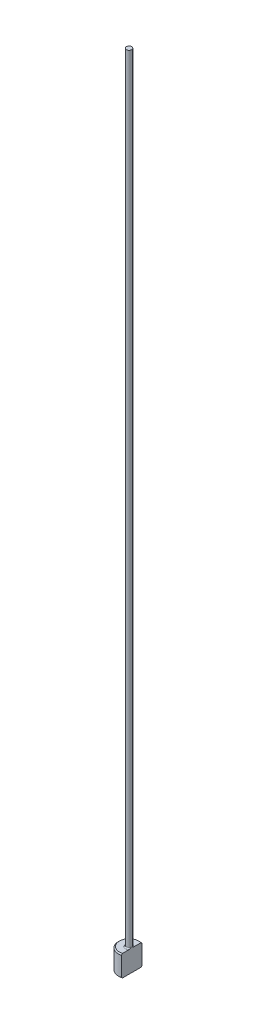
ISO-10303-21;
HEADER;
FILE_DESCRIPTION(('STEP AP214'),'2;1');
FILE_NAME('part.step','',(''),(''),'','','');
FILE_SCHEMA(('AUTOMOTIVE_DESIGN { 1 0 10303 214 1 1 1 1 }'));
ENDSEC;
DATA;
#1=APPLICATION_CONTEXT('core data for automotive mechanical design processes');
#2=APPLICATION_PROTOCOL_DEFINITION('international standard','automotive_design',2000,#1);
#3=PRODUCT_CONTEXT('',#1,'mechanical');
#4=PRODUCT('Part','Part','',(#3));
#5=PRODUCT_RELATED_PRODUCT_CATEGORY('part','',(#4));
#6=PRODUCT_DEFINITION_FORMATION('','',#4);
#7=PRODUCT_DEFINITION_CONTEXT('part definition',#1,'design');
#8=PRODUCT_DEFINITION('design','',#6,#7);
#9=PRODUCT_DEFINITION_SHAPE('','',#8);
#10=(LENGTH_UNIT() NAMED_UNIT(*) SI_UNIT(.MILLI.,.METRE.));
#11=(NAMED_UNIT(*) PLANE_ANGLE_UNIT() SI_UNIT($,.RADIAN.));
#12=(NAMED_UNIT(*) SI_UNIT($,.STERADIAN.) SOLID_ANGLE_UNIT());
#13=UNCERTAINTY_MEASURE_WITH_UNIT(LENGTH_MEASURE(1.E-05),#10,'distance_accuracy_value','');
#14=(GEOMETRIC_REPRESENTATION_CONTEXT(3) GLOBAL_UNCERTAINTY_ASSIGNED_CONTEXT((#13)) GLOBAL_UNIT_ASSIGNED_CONTEXT((#10,
#11,#12)) REPRESENTATION_CONTEXT('',''));
#15=CARTESIAN_POINT('',(0.,0.,0.));
#16=DIRECTION('',(0.,0.,1.));
#17=DIRECTION('',(1.,0.,0.));
#18=AXIS2_PLACEMENT_3D('',#15,#16,#17);
#19=CARTESIAN_POINT('',(0.,0.,0.));
#20=DIRECTION('',(0.,-1.,0.));
#21=DIRECTION('',(0.,0.,-1.));
#22=AXIS2_PLACEMENT_3D('',#19,#20,#21);
#23=PLANE('',#22);
#24=CARTESIAN_POINT('',(0.,0.,0.));
#25=DIRECTION('',(0.,-1.,0.));
#26=DIRECTION('',(0.,0.,-1.));
#27=AXIS2_PLACEMENT_3D('',#24,#25,#26);
#28=CIRCLE('',#27,1.79999999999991);
#29=CARTESIAN_POINT('',(0.499999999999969,0.,1.72916164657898));
#30=VERTEX_POINT('',#29);
#31=CARTESIAN_POINT('',(0.499999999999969,0.,-1.72916164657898));
#32=VERTEX_POINT('',#31);
#33=EDGE_CURVE('E98',#30,#32,#28,.T.);
#34=ORIENTED_EDGE('',*,*,#33,.T.);
#35=DIRECTION('',(0.,0.,1.));
#36=VECTOR('',#35,1.);
#37=CARTESIAN_POINT('',(0.499999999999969,0.,1.93649167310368));
#38=LINE('',#37,#36);
#39=EDGE_CURVE('E83',#32,#30,#38,.T.);
#40=ORIENTED_EDGE('',*,*,#39,.T.);
#41=EDGE_LOOP('',(#34,#40));
#42=FACE_BOUND('',#41,.T.);
#43=ADVANCED_FACE('F32',(#42),#23,.T.);
#44=CARTESIAN_POINT('',(0.,259.958771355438,0.));
#45=DIRECTION('',(0.,1.,0.));
#46=DIRECTION('',(0.,0.,1.));
#47=AXIS2_PLACEMENT_3D('',#44,#45,#46);
#48=CYLINDRICAL_SURFACE('',#47,1.99999999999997);
#49=CARTESIAN_POINT('',(0.,3.79999999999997,0.));
#50=DIRECTION('',(0.,1.,0.));
#51=DIRECTION('',(0.,0.,1.));
#52=AXIS2_PLACEMENT_3D('',#49,#50,#51);
#53=CIRCLE('',#52,1.99999999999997);
#54=CARTESIAN_POINT('',(0.499999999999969,3.79999999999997,1.93649167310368));
#55=VERTEX_POINT('',#54);
#56=CARTESIAN_POINT('',(0.499999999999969,3.79999999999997,-1.93649167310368));
#57=VERTEX_POINT('',#56);
#58=EDGE_CURVE('E104',#55,#57,#53,.F.);
#59=ORIENTED_EDGE('',*,*,#58,.T.);
#60=DIRECTION('',(0.,-1.,0.));
#61=VECTOR('',#60,1.);
#62=CARTESIAN_POINT('',(0.499999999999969,150.,-1.93649167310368));
#63=LINE('',#62,#61);
#64=CARTESIAN_POINT('',(0.499999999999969,0.200000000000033,-1.93649167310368));
#65=VERTEX_POINT('',#64);
#66=EDGE_CURVE('E183',#57,#65,#63,.T.);
#67=ORIENTED_EDGE('',*,*,#66,.T.);
#68=CARTESIAN_POINT('',(0.,0.200000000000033,0.));
#69=DIRECTION('',(0.,-1.,0.));
#70=DIRECTION('',(0.,0.,-1.));
#71=AXIS2_PLACEMENT_3D('',#68,#69,#70);
#72=CIRCLE('',#71,1.99999999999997);
#73=CARTESIAN_POINT('',(0.499999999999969,0.200000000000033,1.93649167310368));
#74=VERTEX_POINT('',#73);
#75=EDGE_CURVE('E100',#65,#74,#72,.F.);
#76=ORIENTED_EDGE('',*,*,#75,.T.);
#77=DIRECTION('',(0.,-1.,0.));
#78=VECTOR('',#77,1.);
#79=CARTESIAN_POINT('',(0.499999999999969,150.,1.93649167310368));
#80=LINE('',#79,#78);
#81=EDGE_CURVE('E93',#55,#74,#80,.T.);
#82=ORIENTED_EDGE('',*,*,#81,.F.);
#83=EDGE_LOOP('',(#59,#67,#76,#82));
#84=FACE_BOUND('',#83,.T.);
#85=ADVANCED_FACE('F158',(#84),#48,.T.);
#86=CARTESIAN_POINT('',(-1.99999999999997,4.,0.));
#87=DIRECTION('',(0.,1.,0.));
#88=DIRECTION('',(0.,0.,1.));
#89=AXIS2_PLACEMENT_3D('',#86,#87,#88);
#90=PLANE('',#89);
#91=CARTESIAN_POINT('',(0.,4.,0.));
#92=DIRECTION('',(0.,1.,0.));
#93=DIRECTION('',(0.,0.,1.));
#94=AXIS2_PLACEMENT_3D('',#91,#92,#93);
#95=CIRCLE('',#94,1.79999999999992);
#96=CARTESIAN_POINT('',(0.499999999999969,4.,-1.72916164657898));
#97=VERTEX_POINT('',#96);
#98=CARTESIAN_POINT('',(0.499999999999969,4.,1.72916164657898));
#99=VERTEX_POINT('',#98);
#100=EDGE_CURVE('E178',#97,#99,#95,.T.);
#101=ORIENTED_EDGE('',*,*,#100,.T.);
#102=DIRECTION('',(0.,0.,-1.));
#103=VECTOR('',#102,1.);
#104=CARTESIAN_POINT('',(0.499999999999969,4.,0.));
#105=LINE('',#104,#103);
#106=CARTESIAN_POINT('',(0.499999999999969,3.99999999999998,0.489897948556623));
#107=VERTEX_POINT('',#106);
#108=EDGE_CURVE('E57',#99,#107,#105,.T.);
#109=ORIENTED_EDGE('',*,*,#108,.T.);
#110=CARTESIAN_POINT('',(0.,4.,0.));
#111=DIRECTION('',(0.,1.,0.));
#112=DIRECTION('',(0.,0.,1.));
#113=AXIS2_PLACEMENT_3D('',#110,#111,#112);
#114=CIRCLE('',#113,0.699999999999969);
#115=CARTESIAN_POINT('',(0.499999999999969,3.99999999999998,-0.489897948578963));
#116=VERTEX_POINT('',#115);
#117=EDGE_CURVE('E107',#107,#116,#114,.F.);
#118=ORIENTED_EDGE('',*,*,#117,.T.);
#119=EDGE_CURVE('E136',#116,#97,#105,.T.);
#120=ORIENTED_EDGE('',*,*,#119,.T.);
#121=EDGE_LOOP('',(#101,#109,#118,#120));
#122=FACE_BOUND('',#121,.T.);
#123=ADVANCED_FACE('F147',(#122),#90,.T.);
#124=CARTESIAN_POINT('',(0.,4.,0.));
#125=DIRECTION('',(0.,-1.,0.));
#126=DIRECTION('',(0.,0.,-1.));
#127=AXIS2_PLACEMENT_3D('',#124,#125,#126);
#128=CONICAL_SURFACE('',#127,1.79999999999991,0.785398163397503);
#129=ORIENTED_EDGE('',*,*,#58,.F.);
#130=CARTESIAN_POINT('',(0.499999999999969,1.50720401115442,4.26357800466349));
#131=CARTESIAN_POINT('',(0.499999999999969,1.62013826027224,4.14986755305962));
#132=CARTESIAN_POINT('',(0.499999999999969,1.73304387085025,4.03612863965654));
#133=CARTESIAN_POINT('',(0.499999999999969,1.95879795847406,3.80854889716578));
#134=CARTESIAN_POINT('',(0.499999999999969,2.07164641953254,3.69470805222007));
#135=CARTESIAN_POINT('',(0.499999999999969,2.29770695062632,3.46645461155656));
#136=CARTESIAN_POINT('',(0.499999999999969,2.41091859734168,3.35204159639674));
#137=CARTESIAN_POINT('',(0.499999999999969,2.63717793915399,3.12309847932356));
#138=CARTESIAN_POINT('',(0.499999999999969,2.75022566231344,3.00856840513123));
#139=CARTESIAN_POINT('',(0.499999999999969,3.04506948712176,2.70936514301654));
#140=CARTESIAN_POINT('',(0.499999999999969,3.22671512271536,2.52454334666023));
#141=CARTESIAN_POINT('',(0.499999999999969,3.49855304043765,2.24655797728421));
#142=CARTESIAN_POINT('',(0.499999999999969,3.58909436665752,2.1537358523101));
#143=CARTESIAN_POINT('',(0.499999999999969,3.76982478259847,1.96776469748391));
#144=CARTESIAN_POINT('',(0.499999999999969,3.86001390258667,1.87461569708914));
#145=CARTESIAN_POINT('',(0.499999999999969,4.03950849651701,1.68818299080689));
#146=CARTESIAN_POINT('',(0.499999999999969,4.12881605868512,1.59490129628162));
#147=CARTESIAN_POINT('',(0.499999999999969,4.30662189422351,1.40750656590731));
#148=CARTESIAN_POINT('',(0.499999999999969,4.39511988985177,1.31339326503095));
#149=CARTESIAN_POINT('',(0.499999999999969,4.52664527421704,1.17121612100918));
#150=CARTESIAN_POINT('',(0.499999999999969,4.57025302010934,1.1236898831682));
#151=CARTESIAN_POINT('',(0.499999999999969,4.65691222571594,1.0281337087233));
#152=CARTESIAN_POINT('',(0.499999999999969,4.69996370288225,0.980103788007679));
#153=CARTESIAN_POINT('',(0.499999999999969,4.78522208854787,0.883344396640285));
#154=CARTESIAN_POINT('',(0.499999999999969,4.82742943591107,0.834615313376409));
#155=CARTESIAN_POINT('',(0.499999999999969,4.91056132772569,0.73607829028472));
#156=CARTESIAN_POINT('',(0.499999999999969,4.95148615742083,0.686270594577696));
#157=CARTESIAN_POINT('',(0.499999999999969,5.00615923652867,0.616697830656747));
#158=CARTESIAN_POINT('',(0.499999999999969,5.02085639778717,0.597679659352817));
#159=CARTESIAN_POINT('',(0.499999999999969,5.04986049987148,0.559345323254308));
#160=CARTESIAN_POINT('',(0.499999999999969,5.0641674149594,0.540029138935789));
#161=CARTESIAN_POINT('',(0.499999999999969,5.09232483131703,0.500987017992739));
#162=CARTESIAN_POINT('',(0.499999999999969,5.10617402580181,0.481260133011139));
#163=CARTESIAN_POINT('',(0.499999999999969,5.13322286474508,0.441366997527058));
#164=CARTESIAN_POINT('',(0.499999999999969,5.14642252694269,0.421200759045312));
#165=CARTESIAN_POINT('',(0.499999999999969,5.18389185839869,0.361317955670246));
#166=CARTESIAN_POINT('',(0.499999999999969,5.20702995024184,0.320875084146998));
#167=CARTESIAN_POINT('',(0.499999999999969,5.24772098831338,0.23733236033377));
#168=CARTESIAN_POINT('',(0.499999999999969,5.26530335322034,0.194247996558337));
#169=CARTESIAN_POINT('',(0.499999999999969,5.28633621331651,0.120860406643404));
#170=CARTESIAN_POINT('',(0.499999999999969,5.29258236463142,0.0913941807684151));
#171=CARTESIAN_POINT('',(0.499999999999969,5.2998467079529,0.0318909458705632));
#172=CARTESIAN_POINT('',(0.499999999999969,5.30088385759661,0.00185640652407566));
#173=CARTESIAN_POINT('',(0.499999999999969,5.29754901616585,-0.0578626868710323));
#174=CARTESIAN_POINT('',(0.499999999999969,5.29318196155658,-0.0875475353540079));
#175=CARTESIAN_POINT('',(0.499999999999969,5.27991452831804,-0.145970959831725));
#176=CARTESIAN_POINT('',(0.499999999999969,5.27099331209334,-0.174704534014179));
#177=CARTESIAN_POINT('',(0.499999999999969,5.24698060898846,-0.238616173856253));
#178=CARTESIAN_POINT('',(0.499999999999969,5.2308674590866,-0.273397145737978));
#179=CARTESIAN_POINT('',(0.499999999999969,5.19533548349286,-0.34125684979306));
#180=CARTESIAN_POINT('',(0.499999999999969,5.17590893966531,-0.374331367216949));
#181=CARTESIAN_POINT('',(0.499999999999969,5.134844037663,-0.439399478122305));
#182=CARTESIAN_POINT('',(0.499999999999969,5.11319038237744,-0.47138326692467));
#183=CARTESIAN_POINT('',(0.499999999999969,5.06854590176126,-0.534336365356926));
#184=CARTESIAN_POINT('',(0.499999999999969,5.04555662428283,-0.565306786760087));
#185=CARTESIAN_POINT('',(0.499999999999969,4.99582113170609,-0.630230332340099));
#186=CARTESIAN_POINT('',(0.499999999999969,4.96895642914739,-0.664092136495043));
#187=CARTESIAN_POINT('',(0.499999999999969,4.91443104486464,-0.731170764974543));
#188=CARTESIAN_POINT('',(0.499999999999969,4.886770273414,-0.764387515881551));
#189=CARTESIAN_POINT('',(0.499999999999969,4.80293478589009,-0.863356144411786));
#190=CARTESIAN_POINT('',(0.499999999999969,4.74592734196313,-0.928400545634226));
#191=CARTESIAN_POINT('',(0.499999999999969,4.63061293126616,-1.05749298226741));
#192=CARTESIAN_POINT('',(0.499999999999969,4.57230411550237,-1.12153934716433));
#193=CARTESIAN_POINT('',(0.499999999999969,4.45494129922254,-1.24891760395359));
#194=CARTESIAN_POINT('',(0.499999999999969,4.39588747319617,-1.31224965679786));
#195=CARTESIAN_POINT('',(0.499999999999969,4.27755243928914,-1.4381601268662));
#196=CARTESIAN_POINT('',(0.499999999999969,4.21827347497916,-1.50074065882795));
#197=CARTESIAN_POINT('',(0.499999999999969,4.09936903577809,-1.62557837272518));
#198=CARTESIAN_POINT('',(0.499999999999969,4.03974354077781,-1.68783553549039));
#199=CARTESIAN_POINT('',(0.499999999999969,3.86059814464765,-1.8741545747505));
#200=CARTESIAN_POINT('',(0.499999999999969,3.74071340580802,-1.99786534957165));
#201=CARTESIAN_POINT('',(0.499999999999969,3.44590639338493,-2.30074922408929));
#202=CARTESIAN_POINT('',(0.499999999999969,3.27068324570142,-2.47962880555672));
#203=CARTESIAN_POINT('',(0.499999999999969,2.91959588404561,-2.83686250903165));
#204=CARTESIAN_POINT('',(0.499999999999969,2.74373149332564,-3.01521645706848));
#205=CARTESIAN_POINT('',(0.499999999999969,2.39118783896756,-3.37205745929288));
#206=CARTESIAN_POINT('',(0.499999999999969,2.21450765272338,-3.55054360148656));
#207=CARTESIAN_POINT('',(0.499999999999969,1.86097190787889,-3.90723139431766));
#208=CARTESIAN_POINT('',(0.499999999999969,1.68411642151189,-4.0854331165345));
#209=CARTESIAN_POINT('',(0.499999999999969,1.50720401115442,-4.26357800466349));
#210=B_SPLINE_CURVE_WITH_KNOTS('',3,(#130,#131,#132,#133,#134,#135,#136,#137,#138,#139,#140,
#141,#142,#143,#144,#145,#146,#147,#148,#149,#150,#151,#152,#153,#154,#155,#156,#157,#158,#159,
#160,#161,#162,#163,#164,#165,#166,#167,#168,#169,#170,#171,#172,#173,#174,#175,#176,#177,#178,
#179,#180,#181,#182,#183,#184,#185,#186,#187,#188,#189,#190,#191,#192,#193,#194,#195,#196,#197,
#198,#199,#200,#201,#202,#203,#204,#205,#206,#207,#208,#209),.UNSPECIFIED.,.F.,.F.,(4,2,2,2,2,2,
2,2,2,2,2,2,2,2,2,2,2,2,2,2,2,2,2,2,2,2,2,2,2,2,2,2,2,2,2,2,2,2,2,4),(0.,0.48078884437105,
0.961674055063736,1.4445454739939,1.92732112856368,2.70474283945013,3.09374505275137,
3.48271306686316,3.87013311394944,4.25768143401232,4.45118175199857,4.64467598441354,
4.83806685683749,5.03141440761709,5.10351649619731,5.17562332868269,5.24792081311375,
5.32021632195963,5.45980182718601,5.59863530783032,5.68861811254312,5.77827319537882,
5.86784644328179,5.95783325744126,6.07253133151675,6.18750032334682,6.30331969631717,
6.41900742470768,6.54866226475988,6.67833177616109,6.93776961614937,7.19760305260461,
7.45737672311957,7.71597304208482,7.97458452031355,8.49138885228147,9.24259169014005,
9.99402016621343,10.747451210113,11.5006463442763),.UNSPECIFIED.);
#211=EDGE_CURVE('E135',#55,#99,#210,.T.);
#212=ORIENTED_EDGE('',*,*,#211,.T.);
#213=ORIENTED_EDGE('',*,*,#100,.F.);
#214=EDGE_CURVE('E127',#97,#57,#210,.T.);
#215=ORIENTED_EDGE('',*,*,#214,.T.);
#216=EDGE_LOOP('',(#129,#212,#213,#215));
#217=FACE_BOUND('',#216,.T.);
#218=ADVANCED_FACE('F143',(#217),#128,.T.);
#219=CARTESIAN_POINT('',(0.,0.200000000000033,0.));
#220=DIRECTION('',(0.,1.,0.));
#221=DIRECTION('',(0.,0.,1.));
#222=AXIS2_PLACEMENT_3D('',#219,#220,#221);
#223=CONICAL_SURFACE('',#222,1.99999999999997,0.785398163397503);
#224=ORIENTED_EDGE('',*,*,#75,.F.);
#225=CARTESIAN_POINT('',(0.499999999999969,2.49279598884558,-4.26357800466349));
#226=CARTESIAN_POINT('',(0.499999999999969,2.37986173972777,-4.14986755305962));
#227=CARTESIAN_POINT('',(0.499999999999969,2.26695612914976,-4.03612863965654));
#228=CARTESIAN_POINT('',(0.499999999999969,2.04120204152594,-3.80854889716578));
#229=CARTESIAN_POINT('',(0.499999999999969,1.92835358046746,-3.69470805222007));
#230=CARTESIAN_POINT('',(0.499999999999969,1.70229304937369,-3.46645461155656));
#231=CARTESIAN_POINT('',(0.499999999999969,1.58908140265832,-3.35204159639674));
#232=CARTESIAN_POINT('',(0.499999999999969,1.36282206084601,-3.12309847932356));
#233=CARTESIAN_POINT('',(0.499999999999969,1.24977433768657,-3.00856840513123));
#234=CARTESIAN_POINT('',(0.499999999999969,0.954930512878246,-2.70936514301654));
#235=CARTESIAN_POINT('',(0.499999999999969,0.77328487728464,-2.52454334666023));
#236=CARTESIAN_POINT('',(0.499999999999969,0.501446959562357,-2.24655797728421));
#237=CARTESIAN_POINT('',(0.499999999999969,0.410905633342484,-2.1537358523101));
#238=CARTESIAN_POINT('',(0.499999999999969,0.230175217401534,-1.96776469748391));
#239=CARTESIAN_POINT('',(0.499999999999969,0.139986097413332,-1.87461569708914));
#240=CARTESIAN_POINT('',(0.499999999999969,-0.039508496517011,-1.68818299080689));
#241=CARTESIAN_POINT('',(0.499999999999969,-0.12881605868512,-1.59490129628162));
#242=CARTESIAN_POINT('',(0.499999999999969,-0.306621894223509,-1.40750656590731));
#243=CARTESIAN_POINT('',(0.499999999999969,-0.395119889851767,-1.31339326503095));
#244=CARTESIAN_POINT('',(0.499999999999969,-0.526645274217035,-1.17121612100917));
#245=CARTESIAN_POINT('',(0.499999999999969,-0.570253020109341,-1.1236898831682));
#246=CARTESIAN_POINT('',(0.499999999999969,-0.656912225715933,-1.0281337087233));
#247=CARTESIAN_POINT('',(0.499999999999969,-0.699963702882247,-0.980103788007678));
#248=CARTESIAN_POINT('',(0.499999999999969,-0.785222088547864,-0.883344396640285));
#249=CARTESIAN_POINT('',(0.499999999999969,-0.827429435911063,-0.834615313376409));
#250=CARTESIAN_POINT('',(0.499999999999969,-0.910561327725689,-0.736078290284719));
#251=CARTESIAN_POINT('',(0.499999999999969,-0.951486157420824,-0.686270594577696));
#252=CARTESIAN_POINT('',(0.499999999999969,-1.00615923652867,-0.616697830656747));
#253=CARTESIAN_POINT('',(0.499999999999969,-1.02085639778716,-0.597679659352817));
#254=CARTESIAN_POINT('',(0.499999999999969,-1.04986049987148,-0.559345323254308));
#255=CARTESIAN_POINT('',(0.499999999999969,-1.0641674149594,-0.540029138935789));
#256=CARTESIAN_POINT('',(0.499999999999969,-1.09232483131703,-0.500987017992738));
#257=CARTESIAN_POINT('',(0.499999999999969,-1.10617402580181,-0.481260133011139));
#258=CARTESIAN_POINT('',(0.499999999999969,-1.13322286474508,-0.441366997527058));
#259=CARTESIAN_POINT('',(0.499999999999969,-1.14642252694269,-0.421200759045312));
#260=CARTESIAN_POINT('',(0.499999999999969,-1.18389185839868,-0.361317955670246));
#261=CARTESIAN_POINT('',(0.499999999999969,-1.20702995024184,-0.320875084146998));
#262=CARTESIAN_POINT('',(0.499999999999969,-1.24772098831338,-0.23733236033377));
#263=CARTESIAN_POINT('',(0.499999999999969,-1.26530335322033,-0.194247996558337));
#264=CARTESIAN_POINT('',(0.499999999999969,-1.2863362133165,-0.120860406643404));
#265=CARTESIAN_POINT('',(0.499999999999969,-1.29258236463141,-0.091394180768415));
#266=CARTESIAN_POINT('',(0.499999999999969,-1.2998467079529,-0.031890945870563));
#267=CARTESIAN_POINT('',(0.499999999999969,-1.30088385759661,-0.0018564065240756));
#268=CARTESIAN_POINT('',(0.499999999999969,-1.29754901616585,0.0578626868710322));
#269=CARTESIAN_POINT('',(0.499999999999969,-1.29318196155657,0.0875475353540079));
#270=CARTESIAN_POINT('',(0.499999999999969,-1.27991452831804,0.145970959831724));
#271=CARTESIAN_POINT('',(0.499999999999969,-1.27099331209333,0.174704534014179));
#272=CARTESIAN_POINT('',(0.499999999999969,-1.24698060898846,0.238616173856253));
#273=CARTESIAN_POINT('',(0.499999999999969,-1.23086745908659,0.273397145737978));
#274=CARTESIAN_POINT('',(0.499999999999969,-1.19533548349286,0.34125684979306));
#275=CARTESIAN_POINT('',(0.499999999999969,-1.17590893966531,0.374331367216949));
#276=CARTESIAN_POINT('',(0.499999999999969,-1.134844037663,0.439399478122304));
#277=CARTESIAN_POINT('',(0.499999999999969,-1.11319038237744,0.47138326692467));
#278=CARTESIAN_POINT('',(0.499999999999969,-1.06854590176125,0.534336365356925));
#279=CARTESIAN_POINT('',(0.499999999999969,-1.04555662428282,0.565306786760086));
#280=CARTESIAN_POINT('',(0.499999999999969,-0.995821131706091,0.630230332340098));
#281=CARTESIAN_POINT('',(0.499999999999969,-0.968956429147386,0.664092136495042));
#282=CARTESIAN_POINT('',(0.499999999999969,-0.914431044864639,0.731170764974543));
#283=CARTESIAN_POINT('',(0.499999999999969,-0.886770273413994,0.764387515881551));
#284=CARTESIAN_POINT('',(0.499999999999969,-0.802934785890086,0.863356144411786));
#285=CARTESIAN_POINT('',(0.499999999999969,-0.745927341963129,0.928400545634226));
#286=CARTESIAN_POINT('',(0.499999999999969,-0.630612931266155,1.05749298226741));
#287=CARTESIAN_POINT('',(0.499999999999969,-0.572304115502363,1.12153934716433));
#288=CARTESIAN_POINT('',(0.499999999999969,-0.45494129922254,1.24891760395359));
#289=CARTESIAN_POINT('',(0.499999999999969,-0.395887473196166,1.31224965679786));
#290=CARTESIAN_POINT('',(0.499999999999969,-0.277552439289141,1.4381601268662));
#291=CARTESIAN_POINT('',(0.499999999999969,-0.218273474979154,1.50074065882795));
#292=CARTESIAN_POINT('',(0.499999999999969,-0.0993690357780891,1.62557837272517));
#293=CARTESIAN_POINT('',(0.499999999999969,-0.0397435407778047,1.68783553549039));
#294=CARTESIAN_POINT('',(0.499999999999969,0.139401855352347,1.87415457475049));
#295=CARTESIAN_POINT('',(0.499999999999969,0.259286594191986,1.99786534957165));
#296=CARTESIAN_POINT('',(0.499999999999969,0.554093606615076,2.30074922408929));
#297=CARTESIAN_POINT('',(0.499999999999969,0.72931675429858,2.47962880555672));
#298=CARTESIAN_POINT('',(0.499999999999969,1.08040411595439,2.83686250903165));
#299=CARTESIAN_POINT('',(0.499999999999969,1.25626850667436,3.01521645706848));
#300=CARTESIAN_POINT('',(0.499999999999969,1.60881216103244,3.37205745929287));
#301=CARTESIAN_POINT('',(0.499999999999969,1.78549234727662,3.55054360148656));
#302=CARTESIAN_POINT('',(0.499999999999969,2.13902809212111,3.90723139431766));
#303=CARTESIAN_POINT('',(0.499999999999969,2.31588357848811,4.0854331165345));
#304=CARTESIAN_POINT('',(0.499999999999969,2.49279598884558,4.26357800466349));
#305=B_SPLINE_CURVE_WITH_KNOTS('',3,(#225,#226,#227,#228,#229,#230,#231,#232,#233,#234,#235,
#236,#237,#238,#239,#240,#241,#242,#243,#244,#245,#246,#247,#248,#249,#250,#251,#252,#253,#254,
#255,#256,#257,#258,#259,#260,#261,#262,#263,#264,#265,#266,#267,#268,#269,#270,#271,#272,#273,
#274,#275,#276,#277,#278,#279,#280,#281,#282,#283,#284,#285,#286,#287,#288,#289,#290,#291,#292,
#293,#294,#295,#296,#297,#298,#299,#300,#301,#302,#303,#304),.UNSPECIFIED.,.F.,.F.,(4,2,2,2,2,2,
2,2,2,2,2,2,2,2,2,2,2,2,2,2,2,2,2,2,2,2,2,2,2,2,2,2,2,2,2,2,2,2,2,4),(0.,0.48078884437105,
0.961674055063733,1.44454547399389,1.92732112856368,2.70474283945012,3.09374505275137,
3.48271306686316,3.87013311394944,4.25768143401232,4.45118175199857,4.64467598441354,
4.83806685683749,5.03141440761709,5.10351649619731,5.1756233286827,5.24792081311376,
5.32021632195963,5.45980182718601,5.59863530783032,5.68861811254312,5.77827319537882,
5.86784644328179,5.95783325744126,6.07253133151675,6.18750032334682,6.30331969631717,
6.41900742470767,6.54866226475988,6.67833177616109,6.93776961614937,7.19760305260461,
7.45737672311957,7.71597304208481,7.97458452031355,8.49138885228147,9.24259169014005,
9.99402016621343,10.747451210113,11.5006463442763),.UNSPECIFIED.);
#306=EDGE_CURVE('E86',#65,#32,#305,.T.);
#307=ORIENTED_EDGE('',*,*,#306,.T.);
#308=ORIENTED_EDGE('',*,*,#33,.F.);
#309=EDGE_CURVE('E89',#30,#74,#305,.T.);
#310=ORIENTED_EDGE('',*,*,#309,.T.);
#311=EDGE_LOOP('',(#224,#307,#308,#310));
#312=FACE_BOUND('',#311,.T.);
#313=ADVANCED_FACE('F97',(#312),#223,.T.);
#314=CARTESIAN_POINT('',(0.,4.19999999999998,0.));
#315=DIRECTION('',(0.,1.,0.));
#316=DIRECTION('',(0.,0.,1.));
#317=AXIS2_PLACEMENT_3D('',#314,#315,#316);
#318=TOROIDAL_SURFACE('',#317,0.699999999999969,0.2);
#319=CARTESIAN_POINT('',(0.499999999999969,4.19999999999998,0.));
#320=CARTESIAN_POINT('',(0.499999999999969,4.20000053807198,-1.276290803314E-10));
#321=CARTESIAN_POINT('',(0.499999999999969,4.20000107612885,-6.32255682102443E-08));
#322=CARTESIAN_POINT('',(0.499999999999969,4.20000213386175,-2.82964879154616E-07));
#323=CARTESIAN_POINT('',(0.499999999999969,4.2000026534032,-4.40183617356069E-07));
#324=CARTESIAN_POINT('',(0.499999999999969,4.2000036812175,-8.27813239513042E-07));
#325=CARTESIAN_POINT('',(0.499999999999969,4.20000418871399,-1.06023394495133E-06));
#326=CARTESIAN_POINT('',(0.499999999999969,4.20000517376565,-1.57839954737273E-06));
#327=CARTESIAN_POINT('',(0.499999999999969,4.20000565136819,-1.86405706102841E-06));
#328=CARTESIAN_POINT('',(0.499999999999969,4.20000714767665,-2.84099907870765E-06));
#329=CARTESIAN_POINT('',(0.499999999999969,4.20000811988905,-3.60394456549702E-06));
#330=CARTESIAN_POINT('',(0.499999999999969,4.20000994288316,-5.23848834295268E-06));
#331=CARTESIAN_POINT('',(0.499999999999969,4.2000107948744,-6.10880987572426E-06));
#332=CARTESIAN_POINT('',(0.499999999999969,4.20001370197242,-9.26870442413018E-06));
#333=CARTESIAN_POINT('',(0.499999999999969,4.20001560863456,-1.16970153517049E-05));
#334=CARTESIAN_POINT('',(0.499999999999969,4.20001898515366,-1.66756205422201E-05));
#335=CARTESIAN_POINT('',(0.499999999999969,4.20002047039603,-1.92160230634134E-05));
#336=CARTESIAN_POINT('',(0.499999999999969,4.20002619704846,-2.92662000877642E-05));
#337=CARTESIAN_POINT('',(0.499999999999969,4.20003022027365,-3.68956532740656E-05));
#338=CARTESIAN_POINT('',(0.499999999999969,4.20003721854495,-5.16224753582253E-05));
#339=CARTESIAN_POINT('',(0.499999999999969,4.20004025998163,-5.86875950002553E-05));
#340=CARTESIAN_POINT('',(0.499999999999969,4.20006250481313,-0.000106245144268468));
#341=CARTESIAN_POINT('',(0.499999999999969,4.2000886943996,-0.000143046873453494));
#342=CARTESIAN_POINT('',(0.499999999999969,4.20018287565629,-0.00028120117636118));
#343=CARTESIAN_POINT('',(0.499999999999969,4.20024565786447,-0.000385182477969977));
#344=CARTESIAN_POINT('',(0.499999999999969,4.20048281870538,-0.000771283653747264));
#345=CARTESIAN_POINT('',(0.499999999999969,4.20066255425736,-0.00105071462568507));
#346=CARTESIAN_POINT('',(0.499999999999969,4.20136218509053,-0.00214472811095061));
#347=CARTESIAN_POINT('',(0.499999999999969,4.20187621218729,-0.00296224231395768));
#348=CARTESIAN_POINT('',(0.499999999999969,4.21204499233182,-0.0191275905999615));
#349=CARTESIAN_POINT('',(0.499999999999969,4.22176135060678,-0.0344456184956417));
#350=CARTESIAN_POINT('',(0.499999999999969,4.24070578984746,-0.0647500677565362));
#351=CARTESIAN_POINT('',(0.499999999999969,4.24993981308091,-0.0797328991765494));
#352=CARTESIAN_POINT('',(0.499999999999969,4.26897796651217,-0.111312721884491));
#353=CARTESIAN_POINT('',(0.499999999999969,4.27875278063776,-0.127927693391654));
#354=CARTESIAN_POINT('',(0.499999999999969,4.29780667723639,-0.161620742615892));
#355=CARTESIAN_POINT('',(0.499999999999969,4.30708102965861,-0.178701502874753));
#356=CARTESIAN_POINT('',(0.499999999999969,4.32980242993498,-0.222999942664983));
#357=CARTESIAN_POINT('',(0.499999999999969,4.34266834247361,-0.250524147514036));
#358=CARTESIAN_POINT('',(0.499999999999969,4.36514581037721,-0.306264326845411));
#359=CARTESIAN_POINT('',(0.499999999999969,4.37481868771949,-0.33445454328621));
#360=CARTESIAN_POINT('',(0.499999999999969,4.38854584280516,-0.386409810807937));
#361=CARTESIAN_POINT('',(0.499999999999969,4.39332419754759,-0.409978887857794));
#362=CARTESIAN_POINT('',(0.499999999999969,4.39948103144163,-0.458484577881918));
#363=CARTESIAN_POINT('',(0.499999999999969,4.40073041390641,-0.483439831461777));
#364=CARTESIAN_POINT('',(0.499999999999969,4.39878549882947,-0.525361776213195));
#365=CARTESIAN_POINT('',(0.499999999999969,4.39685919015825,-0.542385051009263));
#366=CARTESIAN_POINT('',(0.499999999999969,4.39040994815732,-0.575800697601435));
#367=CARTESIAN_POINT('',(0.499999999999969,4.38591117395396,-0.592197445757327));
#368=CARTESIAN_POINT('',(0.499999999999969,4.37526817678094,-0.620627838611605));
#369=CARTESIAN_POINT('',(0.499999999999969,4.36965917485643,-0.632860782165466));
#370=CARTESIAN_POINT('',(0.499999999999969,4.35652191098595,-0.656281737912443));
#371=CARTESIAN_POINT('',(0.499999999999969,4.34899258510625,-0.667469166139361));
#372=CARTESIAN_POINT('',(0.499999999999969,4.33348787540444,-0.686489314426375));
#373=CARTESIAN_POINT('',(0.499999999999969,4.32581455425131,-0.694567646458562));
#374=CARTESIAN_POINT('',(0.499999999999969,4.3092359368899,-0.7093481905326));
#375=CARTESIAN_POINT('',(0.499999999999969,4.30033137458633,-0.716051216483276));
#376=CARTESIAN_POINT('',(0.499999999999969,4.28139900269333,-0.727801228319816));
#377=CARTESIAN_POINT('',(0.499999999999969,4.27136420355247,-0.732837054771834));
#378=CARTESIAN_POINT('',(0.499999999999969,4.25051406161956,-0.740896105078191));
#379=CARTESIAN_POINT('',(0.499999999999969,4.2396991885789,-0.743920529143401));
#380=CARTESIAN_POINT('',(0.499999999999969,4.2189584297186,-0.747541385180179));
#381=CARTESIAN_POINT('',(0.499999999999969,4.2090739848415,-0.748377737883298));
#382=CARTESIAN_POINT('',(0.499999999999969,4.18931562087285,-0.748281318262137));
#383=CARTESIAN_POINT('',(0.499999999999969,4.17944169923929,-0.747349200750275));
#384=CARTESIAN_POINT('',(0.499999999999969,4.16050847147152,-0.743859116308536));
#385=CARTESIAN_POINT('',(0.499999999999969,4.15143326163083,-0.741386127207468));
#386=CARTESIAN_POINT('',(0.499999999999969,4.13380308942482,-0.73500882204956));
#387=CARTESIAN_POINT('',(0.499999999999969,4.12524816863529,-0.731104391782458));
#388=CARTESIAN_POINT('',(0.499999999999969,4.10851288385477,-0.721844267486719));
#389=CARTESIAN_POINT('',(0.499999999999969,4.10036152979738,-0.716436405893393));
#390=CARTESIAN_POINT('',(0.499999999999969,4.08496509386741,-0.704462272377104));
#391=CARTESIAN_POINT('',(0.499999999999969,4.07772021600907,-0.697895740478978));
#392=CARTESIAN_POINT('',(0.499999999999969,4.06343918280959,-0.683009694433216));
#393=CARTESIAN_POINT('',(0.499999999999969,4.05652301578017,-0.674575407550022));
#394=CARTESIAN_POINT('',(0.499999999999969,4.04395017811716,-0.656812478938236));
#395=CARTESIAN_POINT('',(0.499999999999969,4.03829500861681,-0.64748278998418));
#396=CARTESIAN_POINT('',(0.499999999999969,4.02585782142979,-0.623622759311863));
#397=CARTESIAN_POINT('',(0.499999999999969,4.01980001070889,-0.608712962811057));
#398=CARTESIAN_POINT('',(0.499999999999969,4.01019798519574,-0.57815181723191));
#399=CARTESIAN_POINT('',(0.499999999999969,4.00665175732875,-0.56250107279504));
#400=CARTESIAN_POINT('',(0.499999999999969,4.00085035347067,-0.524814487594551));
#401=CARTESIAN_POINT('',(0.499999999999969,3.99960660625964,-0.502624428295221));
#402=CARTESIAN_POINT('',(0.499999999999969,4.00061484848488,-0.458055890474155));
#403=CARTESIAN_POINT('',(0.499999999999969,4.00291806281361,-0.435679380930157));
#404=CARTESIAN_POINT('',(0.499999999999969,4.01287206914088,-0.37662137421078));
#405=CARTESIAN_POINT('',(0.499999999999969,4.02306808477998,-0.340374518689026));
#406=CARTESIAN_POINT('',(0.499999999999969,4.04187976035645,-0.288479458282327));
#407=CARTESIAN_POINT('',(0.499999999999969,4.04850685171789,-0.272022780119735));
#408=CARTESIAN_POINT('',(0.499999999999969,4.06265559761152,-0.239604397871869));
#409=CARTESIAN_POINT('',(0.499999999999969,4.07017183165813,-0.223640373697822));
#410=CARTESIAN_POINT('',(0.499999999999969,4.08582562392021,-0.19226663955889));
#411=CARTESIAN_POINT('',(0.499999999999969,4.09395460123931,-0.176852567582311));
#412=CARTESIAN_POINT('',(0.499999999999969,4.1109061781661,-0.14601066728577));
#413=CARTESIAN_POINT('',(0.499999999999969,4.11973937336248,-0.130588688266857));
#414=CARTESIAN_POINT('',(0.499999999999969,4.13454771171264,-0.105462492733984));
#415=CARTESIAN_POINT('',(0.499999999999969,4.14041135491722,-0.0956918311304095));
#416=CARTESIAN_POINT('',(0.499999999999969,4.15220833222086,-0.0762990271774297));
#417=CARTESIAN_POINT('',(0.499999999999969,4.15814073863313,-0.0666763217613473));
#418=CARTESIAN_POINT('',(0.499999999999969,4.16956358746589,-0.0482958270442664));
#419=CARTESIAN_POINT('',(0.499999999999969,4.17504841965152,-0.0395344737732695));
#420=CARTESIAN_POINT('',(0.499999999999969,4.18623643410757,-0.0217806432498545));
#421=CARTESIAN_POINT('',(0.499999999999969,4.1919412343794,-0.0127891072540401));
#422=CARTESIAN_POINT('',(0.499999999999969,4.19812331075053,-0.00296314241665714));
#423=CARTESIAN_POINT('',(0.499999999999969,4.19863673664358,-0.00214646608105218));
#424=CARTESIAN_POINT('',(0.499999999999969,4.19933619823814,-0.00105268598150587));
#425=CARTESIAN_POINT('',(0.499999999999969,4.19951633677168,-0.00077263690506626));
#426=CARTESIAN_POINT('',(0.499999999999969,4.199753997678,-0.000385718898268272));
#427=CARTESIAN_POINT('',(0.499999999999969,4.19981689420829,-0.000281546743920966));
#428=CARTESIAN_POINT('',(0.499999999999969,4.1999112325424,-0.000143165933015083));
#429=CARTESIAN_POINT('',(0.499999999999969,4.19993745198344,-0.000106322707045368));
#430=CARTESIAN_POINT('',(0.499999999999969,4.19995971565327,-5.87132323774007E-05));
#431=CARTESIAN_POINT('',(0.499999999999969,4.19996275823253,-5.1643619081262E-05));
#432=CARTESIAN_POINT('',(0.499999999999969,4.19996976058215,-3.69075222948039E-05));
#433=CARTESIAN_POINT('',(0.499999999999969,4.19997378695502,-2.92733864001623E-05));
#434=CARTESIAN_POINT('',(0.499999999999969,4.19997951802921,-1.92179207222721E-05));
#435=CARTESIAN_POINT('',(0.499999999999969,4.19998100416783,-1.66766583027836E-05));
#436=CARTESIAN_POINT('',(0.499999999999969,4.19998438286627,-1.16965321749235E-05));
#437=CARTESIAN_POINT('',(0.499999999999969,4.19998629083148,-9.26757624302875E-06));
#438=CARTESIAN_POINT('',(0.499999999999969,4.19998919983,-6.10711791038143E-06));
#439=CARTESIAN_POINT('',(0.499999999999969,4.19999005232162,-5.23671652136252E-06));
#440=CARTESIAN_POINT('',(0.499999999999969,4.19999187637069,-3.60211739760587E-06));
#441=CARTESIAN_POINT('',(0.499999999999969,4.1999928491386,-2.83919806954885E-06));
#442=CARTESIAN_POINT('',(0.499999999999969,4.19999434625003,-1.86241401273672E-06));
#443=CARTESIAN_POINT('',(0.499999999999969,4.19999482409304,-1.57682668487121E-06));
#444=CARTESIAN_POINT('',(0.499999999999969,4.19999580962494,-1.05884216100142E-06));
#445=CARTESIAN_POINT('',(0.499999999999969,4.19999631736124,-8.26532461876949E-07));
#446=CARTESIAN_POINT('',(0.499999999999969,4.19999734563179,-4.39174206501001E-07));
#447=CARTESIAN_POINT('',(0.499999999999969,4.19999786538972,-2.82113668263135E-07));
#448=CARTESIAN_POINT('',(0.499999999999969,4.19999892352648,-6.27517720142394E-08));
#449=CARTESIAN_POINT('',(0.499999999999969,4.1999994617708,1.27666362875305E-10));
#450=CARTESIAN_POINT('',(0.499999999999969,4.19999999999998,0.));
#451=B_SPLINE_CURVE_WITH_KNOTS('',3,(#319,#320,#321,#322,#323,#324,#325,#326,#327,#328,#329,
#330,#331,#332,#333,#334,#335,#336,#337,#338,#339,#340,#341,#342,#343,#344,#345,#346,#347,#348,
#349,#350,#351,#352,#353,#354,#355,#356,#357,#358,#359,#360,#361,#362,#363,#364,#365,#366,#367,
#368,#369,#370,#371,#372,#373,#374,#375,#376,#377,#378,#379,#380,#381,#382,#383,#384,#385,#386,
#387,#388,#389,#390,#391,#392,#393,#394,#395,#396,#397,#398,#399,#400,#401,#402,#403,#404,#405,
#406,#407,#408,#409,#410,#411,#412,#413,#414,#415,#416,#417,#418,#419,#420,#421,#422,#423,#424,
#425,#426,#427,#428,#429,#430,#431,#432,#433,#434,#435,#436,#437,#438,#439,#440,#441,#442,#443,
#444,#445,#446,#447,#448,#449,#450),.UNSPECIFIED.,.T.,.F.,(4,2,2,2,2,2,2,2,2,2,2,2,2,2,2,2,2,2,
2,2,2,2,2,2,2,2,2,2,2,2,2,2,2,2,2,2,2,2,2,2,2,2,2,2,2,2,2,2,2,2,2,2,2,2,2,2,2,2,2,2,2,2,2,2,2,
4),(0.,1.61264141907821E-06,3.23527813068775E-06,4.9054647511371E-06,6.57293368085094E-06,
1.02633727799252E-05,1.39135331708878E-05,2.31348502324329E-05,3.19553030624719E-05,
5.78146512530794E-05,8.08644760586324E-05,0.000215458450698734,0.000580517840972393,
0.00157645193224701,0.0044742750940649,0.0588833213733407,0.111683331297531,0.169505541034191,
0.22780257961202,0.318834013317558,0.407998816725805,0.479955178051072,0.55451173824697,
0.605741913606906,0.656498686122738,0.696722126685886,0.736967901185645,0.770257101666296,
0.803526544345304,0.837014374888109,0.87048220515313,0.90008770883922,0.929682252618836,
0.957773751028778,0.985867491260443,1.0150939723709,1.04432701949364,1.07692454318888,
1.10956066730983,1.15757154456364,1.20554389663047,1.27185088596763,1.33912449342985,
1.45136032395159,1.50457430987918,1.55747915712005,1.6097463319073,1.66305527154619,
1.69723993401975,1.73115218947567,1.76216312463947,1.79410330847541,1.79699806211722,
1.79799620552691,1.79836193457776,1.79849668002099,1.79851974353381,1.79854561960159,
1.79855444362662,1.79856366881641,1.79856732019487,1.79857101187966,1.79857267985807,
1.79857435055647,1.79857597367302,1.79857758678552),.UNSPECIFIED.);
#452=CARTESIAN_POINT('',(0.499999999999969,4.19999999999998,0.));
#453=VERTEX_POINT('',#452);
#454=EDGE_CURVE('E11',#116,#453,#451,.T.);
#455=ORIENTED_EDGE('',*,*,#454,.F.);
#456=ORIENTED_EDGE('',*,*,#117,.F.);
#457=CARTESIAN_POINT('',(0.499999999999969,4.19999999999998,0.));
#458=CARTESIAN_POINT('',(0.499999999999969,4.19999946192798,1.27629069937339E-10));
#459=CARTESIAN_POINT('',(0.499999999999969,4.19999892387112,6.32255681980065E-08));
#460=CARTESIAN_POINT('',(0.499999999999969,4.19999786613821,2.82964879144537E-07));
#461=CARTESIAN_POINT('',(0.499999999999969,4.19999734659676,4.40183617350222E-07));
#462=CARTESIAN_POINT('',(0.499999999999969,4.19999631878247,8.27813239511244E-07));
#463=CARTESIAN_POINT('',(0.499999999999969,4.19999581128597,1.06023394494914E-06));
#464=CARTESIAN_POINT('',(0.499999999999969,4.19999482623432,1.57839954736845E-06));
#465=CARTESIAN_POINT('',(0.499999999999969,4.19999434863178,1.86405706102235E-06));
#466=CARTESIAN_POINT('',(0.499999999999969,4.19999285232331,2.84099907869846E-06));
#467=CARTESIAN_POINT('',(0.499999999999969,4.19999188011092,3.60394456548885E-06));
#468=CARTESIAN_POINT('',(0.499999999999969,4.19999005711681,5.23848834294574E-06));
#469=CARTESIAN_POINT('',(0.499999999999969,4.19998920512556,6.10880987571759E-06));
#470=CARTESIAN_POINT('',(0.499999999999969,4.19998629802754,9.26870442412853E-06));
#471=CARTESIAN_POINT('',(0.499999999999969,4.1999843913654,1.16970153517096E-05));
#472=CARTESIAN_POINT('',(0.499999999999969,4.1999810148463,1.66756205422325E-05));
#473=CARTESIAN_POINT('',(0.499999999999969,4.19997952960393,1.92160230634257E-05));
#474=CARTESIAN_POINT('',(0.499999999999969,4.1999738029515,2.92662000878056E-05));
#475=CARTESIAN_POINT('',(0.499999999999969,4.19996977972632,3.68956532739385E-05));
#476=CARTESIAN_POINT('',(0.499999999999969,4.19996278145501,5.16224753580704E-05));
#477=CARTESIAN_POINT('',(0.499999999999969,4.19995974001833,5.86875950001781E-05));
#478=CARTESIAN_POINT('',(0.499999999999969,4.19993749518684,0.000106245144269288));
#479=CARTESIAN_POINT('',(0.499999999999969,4.19991130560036,0.000143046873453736));
#480=CARTESIAN_POINT('',(0.499999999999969,4.19981712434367,0.000281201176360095));
#481=CARTESIAN_POINT('',(0.499999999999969,4.19975434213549,0.00038518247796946));
#482=CARTESIAN_POINT('',(0.499999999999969,4.19951718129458,0.000771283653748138));
#483=CARTESIAN_POINT('',(0.499999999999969,4.1993374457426,0.00105071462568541));
#484=CARTESIAN_POINT('',(0.499999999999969,4.19863781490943,0.00214472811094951));
#485=CARTESIAN_POINT('',(0.499999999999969,4.19812378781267,0.00296224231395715));
#486=CARTESIAN_POINT('',(0.499999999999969,4.18795500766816,0.0191275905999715));
#487=CARTESIAN_POINT('',(0.499999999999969,4.17823864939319,0.034445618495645));
#488=CARTESIAN_POINT('',(0.499999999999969,4.1592942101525,0.0647500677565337));
#489=CARTESIAN_POINT('',(0.499999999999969,4.15006018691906,0.0797328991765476));
#490=CARTESIAN_POINT('',(0.499999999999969,4.13102203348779,0.11131272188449));
#491=CARTESIAN_POINT('',(0.499999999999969,4.1212472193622,0.127927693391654));
#492=CARTESIAN_POINT('',(0.499999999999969,4.10219332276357,0.161620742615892));
#493=CARTESIAN_POINT('',(0.499999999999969,4.09291897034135,0.178701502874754));
#494=CARTESIAN_POINT('',(0.499999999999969,4.07019757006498,0.222999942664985));
#495=CARTESIAN_POINT('',(0.499999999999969,4.05733165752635,0.250524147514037));
#496=CARTESIAN_POINT('',(0.499999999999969,4.03485418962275,0.306264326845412));
#497=CARTESIAN_POINT('',(0.499999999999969,4.02518131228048,0.334454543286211));
#498=CARTESIAN_POINT('',(0.499999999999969,4.0114541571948,0.386409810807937));
#499=CARTESIAN_POINT('',(0.499999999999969,4.00667580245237,0.409978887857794));
#500=CARTESIAN_POINT('',(0.499999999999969,4.00051896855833,0.458484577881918));
#501=CARTESIAN_POINT('',(0.499999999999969,3.99926958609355,0.483439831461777));
#502=CARTESIAN_POINT('',(0.499999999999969,4.0012145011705,0.525361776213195));
#503=CARTESIAN_POINT('',(0.499999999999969,4.00314080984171,0.542385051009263));
#504=CARTESIAN_POINT('',(0.499999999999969,4.00959005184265,0.575800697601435));
#505=CARTESIAN_POINT('',(0.499999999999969,4.014088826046,0.592197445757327));
#506=CARTESIAN_POINT('',(0.499999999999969,4.02473182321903,0.620627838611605));
#507=CARTESIAN_POINT('',(0.499999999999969,4.03034082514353,0.632860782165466));
#508=CARTESIAN_POINT('',(0.499999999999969,4.04347808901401,0.656281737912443));
#509=CARTESIAN_POINT('',(0.499999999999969,4.05100741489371,0.667469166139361));
#510=CARTESIAN_POINT('',(0.499999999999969,4.06651212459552,0.686489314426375));
#511=CARTESIAN_POINT('',(0.499999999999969,4.07418544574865,0.694567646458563));
#512=CARTESIAN_POINT('',(0.499999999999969,4.09076406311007,0.7093481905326));
#513=CARTESIAN_POINT('',(0.499999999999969,4.09966862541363,0.716051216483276));
#514=CARTESIAN_POINT('',(0.499999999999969,4.11860099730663,0.727801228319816));
#515=CARTESIAN_POINT('',(0.499999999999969,4.12863579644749,0.732837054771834));
#516=CARTESIAN_POINT('',(0.499999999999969,4.14948593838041,0.740896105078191));
#517=CARTESIAN_POINT('',(0.499999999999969,4.16030081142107,0.743920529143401));
#518=CARTESIAN_POINT('',(0.499999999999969,4.18104157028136,0.747541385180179));
#519=CARTESIAN_POINT('',(0.499999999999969,4.19092601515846,0.748377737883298));
#520=CARTESIAN_POINT('',(0.499999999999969,4.21068437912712,0.748281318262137));
#521=CARTESIAN_POINT('',(0.499999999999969,4.22055830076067,0.747349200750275));
#522=CARTESIAN_POINT('',(0.499999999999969,4.23949152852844,0.743859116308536));
#523=CARTESIAN_POINT('',(0.499999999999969,4.24856673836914,0.741386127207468));
#524=CARTESIAN_POINT('',(0.499999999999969,4.26619691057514,0.73500882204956));
#525=CARTESIAN_POINT('',(0.499999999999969,4.27475183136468,0.731104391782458));
#526=CARTESIAN_POINT('',(0.499999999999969,4.29148711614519,0.721844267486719));
#527=CARTESIAN_POINT('',(0.499999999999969,4.29963847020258,0.716436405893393));
#528=CARTESIAN_POINT('',(0.499999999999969,4.31503490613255,0.704462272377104));
#529=CARTESIAN_POINT('',(0.499999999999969,4.3222797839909,0.697895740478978));
#530=CARTESIAN_POINT('',(0.499999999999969,4.33656081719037,0.683009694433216));
#531=CARTESIAN_POINT('',(0.499999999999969,4.34347698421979,0.674575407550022));
#532=CARTESIAN_POINT('',(0.499999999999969,4.3560498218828,0.656812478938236));
#533=CARTESIAN_POINT('',(0.499999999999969,4.36170499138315,0.64748278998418));
#534=CARTESIAN_POINT('',(0.499999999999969,4.37414217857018,0.623622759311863));
#535=CARTESIAN_POINT('',(0.499999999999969,4.38019998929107,0.608712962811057));
#536=CARTESIAN_POINT('',(0.499999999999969,4.38980201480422,0.57815181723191));
#537=CARTESIAN_POINT('',(0.499999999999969,4.39334824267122,0.56250107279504));
#538=CARTESIAN_POINT('',(0.499999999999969,4.39914964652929,0.524814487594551));
#539=CARTESIAN_POINT('',(0.499999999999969,4.40039339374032,0.502624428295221));
#540=CARTESIAN_POINT('',(0.499999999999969,4.39938515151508,0.458055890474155));
#541=CARTESIAN_POINT('',(0.499999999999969,4.39708193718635,0.435679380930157));
#542=CARTESIAN_POINT('',(0.499999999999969,4.38712793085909,0.37662137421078));
#543=CARTESIAN_POINT('',(0.499999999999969,4.37693191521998,0.340374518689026));
#544=CARTESIAN_POINT('',(0.499999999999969,4.35812023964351,0.288479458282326));
#545=CARTESIAN_POINT('',(0.499999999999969,4.35149314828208,0.272022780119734));
#546=CARTESIAN_POINT('',(0.499999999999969,4.33734440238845,0.239604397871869));
#547=CARTESIAN_POINT('',(0.499999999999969,4.32982816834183,0.223640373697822));
#548=CARTESIAN_POINT('',(0.499999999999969,4.31417437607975,0.19226663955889));
#549=CARTESIAN_POINT('',(0.499999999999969,4.30604539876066,0.176852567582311));
#550=CARTESIAN_POINT('',(0.499999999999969,4.28909382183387,0.14601066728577));
#551=CARTESIAN_POINT('',(0.499999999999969,4.28026062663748,0.130588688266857));
#552=CARTESIAN_POINT('',(0.499999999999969,4.26545228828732,0.105462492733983));
#553=CARTESIAN_POINT('',(0.499999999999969,4.25958864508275,0.095691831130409));
#554=CARTESIAN_POINT('',(0.499999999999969,4.2477916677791,0.0762990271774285));
#555=CARTESIAN_POINT('',(0.499999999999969,4.24185926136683,0.0666763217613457));
#556=CARTESIAN_POINT('',(0.499999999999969,4.23043641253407,0.0482958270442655));
#557=CARTESIAN_POINT('',(0.499999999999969,4.22495158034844,0.0395344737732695));
#558=CARTESIAN_POINT('',(0.499999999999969,4.21376356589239,0.021780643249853));
#559=CARTESIAN_POINT('',(0.499999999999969,4.20805876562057,0.0127891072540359));
#560=CARTESIAN_POINT('',(0.499999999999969,4.20187668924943,0.00296314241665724));
#561=CARTESIAN_POINT('',(0.499999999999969,4.20136326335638,0.00214646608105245));
#562=CARTESIAN_POINT('',(0.499999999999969,4.20066380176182,0.00105268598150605));
#563=CARTESIAN_POINT('',(0.499999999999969,4.20048366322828,0.000772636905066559));
#564=CARTESIAN_POINT('',(0.499999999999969,4.20024600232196,0.000385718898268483));
#565=CARTESIAN_POINT('',(0.499999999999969,4.20018310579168,0.000281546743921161));
#566=CARTESIAN_POINT('',(0.499999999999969,4.20008876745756,0.000143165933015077));
#567=CARTESIAN_POINT('',(0.499999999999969,4.20006254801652,0.000106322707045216));
#568=CARTESIAN_POINT('',(0.499999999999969,4.2000402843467,5.87132323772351E-05));
#569=CARTESIAN_POINT('',(0.499999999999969,4.20003724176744,5.16436190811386E-05));
#570=CARTESIAN_POINT('',(0.499999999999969,4.20003023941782,3.69075222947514E-05));
#571=CARTESIAN_POINT('',(0.499999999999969,4.20002621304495,2.92733864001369E-05));
#572=CARTESIAN_POINT('',(0.499999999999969,4.20002048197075,1.92179207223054E-05));
#573=CARTESIAN_POINT('',(0.499999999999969,4.20001899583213,1.66766583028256E-05));
#574=CARTESIAN_POINT('',(0.499999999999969,4.2000156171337,1.16965321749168E-05));
#575=CARTESIAN_POINT('',(0.499999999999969,4.20001370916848,9.26757624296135E-06));
#576=CARTESIAN_POINT('',(0.499999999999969,4.20001080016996,6.10711791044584E-06));
#577=CARTESIAN_POINT('',(0.499999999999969,4.20000994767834,5.2367165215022E-06));
#578=CARTESIAN_POINT('',(0.499999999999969,4.20000812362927,3.60211739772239E-06));
#579=CARTESIAN_POINT('',(0.499999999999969,4.20000715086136,2.83919806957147E-06));
#580=CARTESIAN_POINT('',(0.499999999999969,4.20000565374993,1.86241401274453E-06));
#581=CARTESIAN_POINT('',(0.499999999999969,4.20000517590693,1.57682668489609E-06));
#582=CARTESIAN_POINT('',(0.499999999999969,4.20000419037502,1.05884216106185E-06));
#583=CARTESIAN_POINT('',(0.499999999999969,4.20000368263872,8.26532461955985E-07));
#584=CARTESIAN_POINT('',(0.499999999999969,4.20000265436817,4.39174206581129E-07));
#585=CARTESIAN_POINT('',(0.499999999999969,4.20000213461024,2.82113668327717E-07));
#586=CARTESIAN_POINT('',(0.499999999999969,4.20000107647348,6.2751772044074E-08));
#587=CARTESIAN_POINT('',(0.499999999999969,4.20000053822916,-1.276663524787E-10));
#588=CARTESIAN_POINT('',(0.499999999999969,4.19999999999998,0.));
#589=B_SPLINE_CURVE_WITH_KNOTS('',3,(#457,#458,#459,#460,#461,#462,#463,#464,#465,#466,#467,
#468,#469,#470,#471,#472,#473,#474,#475,#476,#477,#478,#479,#480,#481,#482,#483,#484,#485,#486,
#487,#488,#489,#490,#491,#492,#493,#494,#495,#496,#497,#498,#499,#500,#501,#502,#503,#504,#505,
#506,#507,#508,#509,#510,#511,#512,#513,#514,#515,#516,#517,#518,#519,#520,#521,#522,#523,#524,
#525,#526,#527,#528,#529,#530,#531,#532,#533,#534,#535,#536,#537,#538,#539,#540,#541,#542,#543,
#544,#545,#546,#547,#548,#549,#550,#551,#552,#553,#554,#555,#556,#557,#558,#559,#560,#561,#562,
#563,#564,#565,#566,#567,#568,#569,#570,#571,#572,#573,#574,#575,#576,#577,#578,#579,#580,#581,
#582,#583,#584,#585,#586,#587,#588),.UNSPECIFIED.,.T.,.F.,(4,2,2,2,2,2,2,2,2,2,2,2,2,2,2,2,2,2,
2,2,2,2,2,2,2,2,2,2,2,2,2,2,2,2,2,2,2,2,2,2,2,2,2,2,2,2,2,2,2,2,2,2,2,2,2,2,2,2,2,2,2,2,2,2,2,
4),(0.,1.61264141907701E-06,3.23527813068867E-06,4.90546475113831E-06,6.57293368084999E-06,
1.0263372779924E-05,1.39135331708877E-05,2.31348502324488E-05,3.19553030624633E-05,
5.78146512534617E-05,8.08644760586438E-05,0.000215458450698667,0.000580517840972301,
0.00157645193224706,0.00447427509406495,0.0588833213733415,0.111683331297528,0.169505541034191,
0.227802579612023,0.31883401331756,0.407998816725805,0.479955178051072,0.55451173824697,
0.605741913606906,0.656498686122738,0.696722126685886,0.736967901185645,0.770257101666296,
0.803526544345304,0.837014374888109,0.87048220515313,0.90008770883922,0.929682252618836,
0.957773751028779,0.985867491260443,1.0150939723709,1.04432701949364,1.07692454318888,
1.10956066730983,1.15757154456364,1.20554389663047,1.27185088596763,1.33912449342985,
1.45136032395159,1.50457430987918,1.55747915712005,1.6097463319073,1.66305527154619,
1.69723993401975,1.73115218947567,1.76216312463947,1.79410330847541,1.79699806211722,
1.79799620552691,1.79836193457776,1.79849668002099,1.79851974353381,1.79854561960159,
1.79855444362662,1.79856366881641,1.79856732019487,1.79857101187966,1.79857267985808,
1.79857435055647,1.79857597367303,1.79857758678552),.UNSPECIFIED.);
#590=EDGE_CURVE('E46',#453,#107,#589,.T.);
#591=ORIENTED_EDGE('',*,*,#590,.F.);
#592=CARTESIAN_POINT('',(0.,4.19999999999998,0.));
#593=DIRECTION('',(0.,1.,0.));
#594=DIRECTION('',(0.,0.,1.));
#595=AXIS2_PLACEMENT_3D('',#592,#593,#594);
#596=CIRCLE('',#595,0.499999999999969);
#597=EDGE_CURVE('E103',#453,#453,#596,.T.);
#598=ORIENTED_EDGE('',*,*,#597,.F.);
#599=EDGE_LOOP('',(#455,#456,#591,#598));
#600=FACE_BOUND('',#599,.T.);
#601=ADVANCED_FACE('F34',(#600),#318,.F.);
#602=CARTESIAN_POINT('',(0.,259.958771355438,0.));
#603=DIRECTION('',(0.,1.,0.));
#604=DIRECTION('',(0.,0.,1.));
#605=AXIS2_PLACEMENT_3D('',#602,#603,#604);
#606=CYLINDRICAL_SURFACE('',#605,0.499999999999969);
#607=ORIENTED_EDGE('',*,*,#597,.T.);
#608=EDGE_LOOP('',(#607));
#609=FACE_BOUND('',#608,.T.);
#610=CARTESIAN_POINT('',(0.,150.,0.));
#611=DIRECTION('',(0.,1.,0.));
#612=DIRECTION('',(0.,0.,1.));
#613=AXIS2_PLACEMENT_3D('',#610,#611,#612);
#614=CIRCLE('',#613,0.499999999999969);
#615=CARTESIAN_POINT('',(0.,150.,0.499999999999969));
#616=VERTEX_POINT('',#615);
#617=EDGE_CURVE('E101',#616,#616,#614,.T.);
#618=ORIENTED_EDGE('',*,*,#617,.F.);
#619=EDGE_LOOP('',(#618));
#620=FACE_BOUND('',#619,.T.);
#621=ADVANCED_FACE('F155',(#609,#620),#606,.T.);
#622=CARTESIAN_POINT('',(-0.499999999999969,150.,0.));
#623=DIRECTION('',(0.,1.,0.));
#624=DIRECTION('',(0.,0.,1.));
#625=AXIS2_PLACEMENT_3D('',#622,#623,#624);
#626=PLANE('',#625);
#627=ORIENTED_EDGE('',*,*,#617,.T.);
#628=EDGE_LOOP('',(#627));
#629=FACE_BOUND('',#628,.T.);
#630=ADVANCED_FACE('F121',(#629),#626,.T.);
#631=CARTESIAN_POINT('',(0.499999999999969,150.,1.93649167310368));
#632=DIRECTION('',(1.,0.,0.));
#633=DIRECTION('',(0.,0.,-1.));
#634=AXIS2_PLACEMENT_3D('',#631,#632,#633);
#635=PLANE('',#634);
#636=ORIENTED_EDGE('',*,*,#66,.F.);
#637=ORIENTED_EDGE('',*,*,#214,.F.);
#638=ORIENTED_EDGE('',*,*,#119,.F.);
#639=ORIENTED_EDGE('',*,*,#454,.T.);
#640=ORIENTED_EDGE('',*,*,#590,.T.);
#641=ORIENTED_EDGE('',*,*,#108,.F.);
#642=ORIENTED_EDGE('',*,*,#211,.F.);
#643=ORIENTED_EDGE('',*,*,#81,.T.);
#644=ORIENTED_EDGE('',*,*,#309,.F.);
#645=ORIENTED_EDGE('',*,*,#39,.F.);
#646=ORIENTED_EDGE('',*,*,#306,.F.);
#647=EDGE_LOOP('',(#636,#637,#638,#639,#640,#641,#642,#643,#644,#645,#646));
#648=FACE_BOUND('',#647,.T.);
#649=ADVANCED_FACE('F85',(#648),#635,.T.);
#650=CLOSED_SHELL('',(#43,#85,#123,#218,#313,#601,#621,#630,#649));
#651=MANIFOLD_SOLID_BREP('B2',#650);
#652=ADVANCED_BREP_SHAPE_REPRESENTATION('',(#18,#651),#14);
#653=SHAPE_DEFINITION_REPRESENTATION(#9,#652);
ENDSEC;
END-ISO-10303-21;
